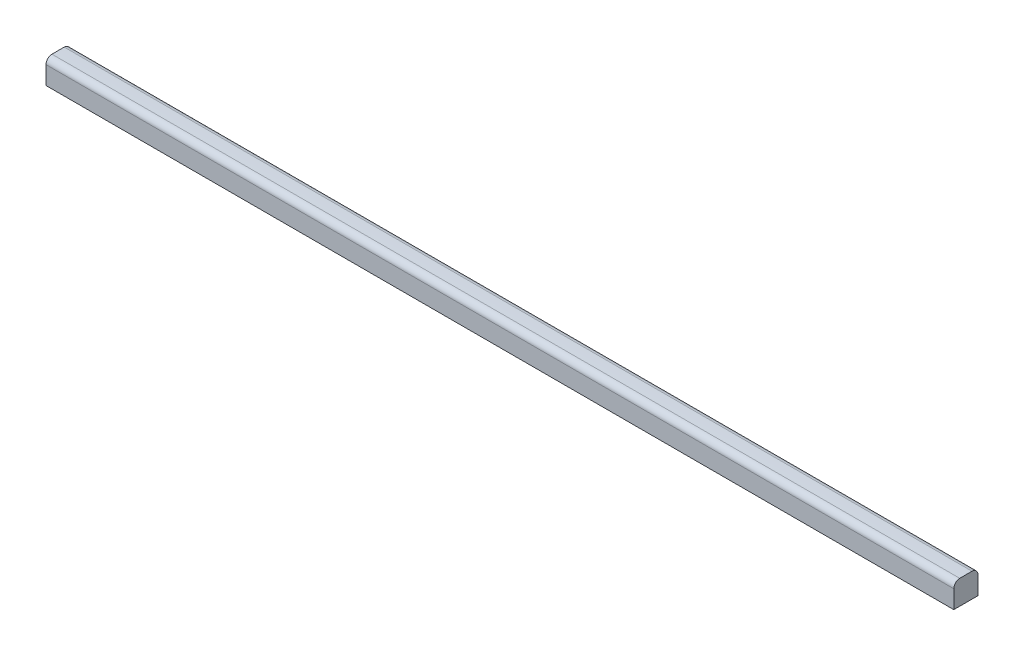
from build123d import *

# Parameters (mm, degrees)
EXTRUDE_1_DEPTH = 150
FILLET_1_R      = 1


with BuildPart() as part:
    # Sketch 2 → Extrude 1 (new body)
    with BuildSketch(Plane(origin=(0, 0, 0), x_dir=(0, 0, -1), z_dir=(1, 0, 0))):
        with BuildLine():
            Line((2, 71), (2, 74.973328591))
            ThreePointArc((2, 74.973328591), (0, 75), (-2, 74.973328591))
            Line((-2, 74.973328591), (-2, 71))
            Line((-2, 71), (2, 71))
        make_face()
    extrude(amount=EXTRUDE_1_DEPTH)

    # Fillet 1
    fillet_1_edges = [part.edges().sort_by_distance(p)[0] for p in [
        (75, 74.973328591, 2),
        (75, 74.973328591, -2),
    ]]
    fillet(fillet_1_edges, radius=FILLET_1_R)


solid = part.part
